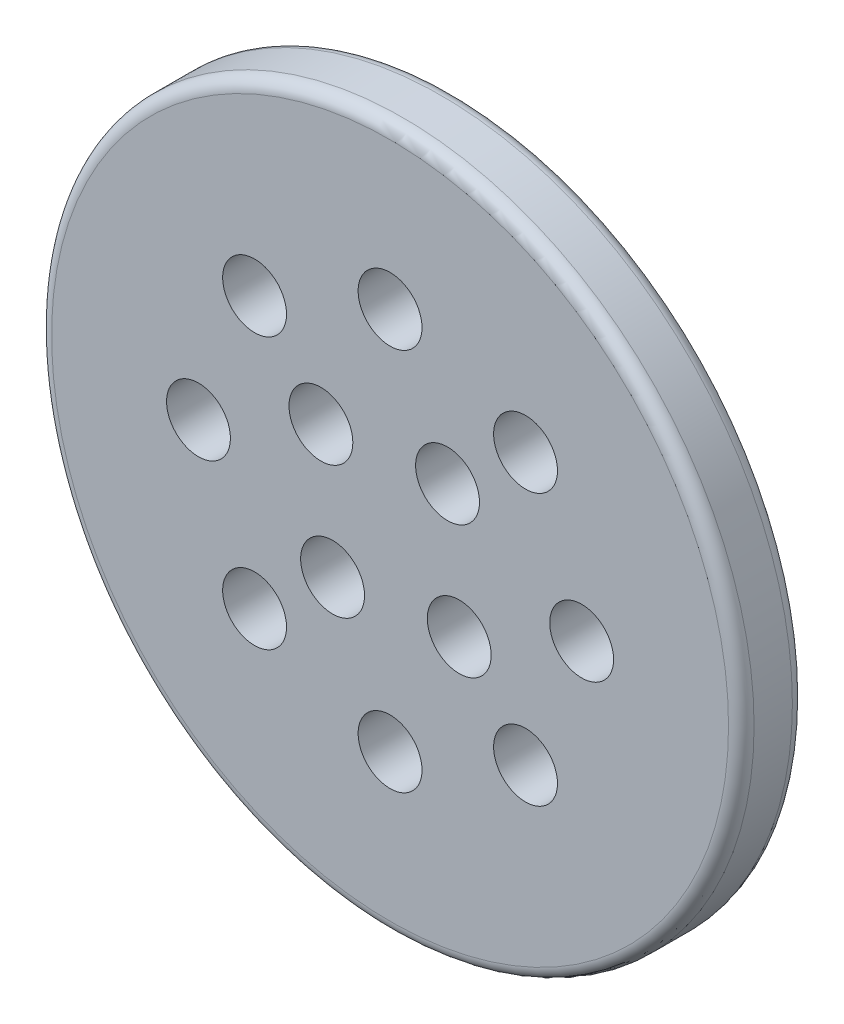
ISO-10303-21;
HEADER;
FILE_DESCRIPTION(('STEP AP214'),'2;1');
FILE_NAME('part.step','',(''),(''),'','','');
FILE_SCHEMA(('AUTOMOTIVE_DESIGN { 1 0 10303 214 1 1 1 1 }'));
ENDSEC;
DATA;
#1=APPLICATION_CONTEXT('core data for automotive mechanical design processes');
#2=APPLICATION_PROTOCOL_DEFINITION('international standard','automotive_design',2000,#1);
#3=PRODUCT_CONTEXT('',#1,'mechanical');
#4=PRODUCT('Part','Part','',(#3));
#5=PRODUCT_RELATED_PRODUCT_CATEGORY('part','',(#4));
#6=PRODUCT_DEFINITION_FORMATION('','',#4);
#7=PRODUCT_DEFINITION_CONTEXT('part definition',#1,'design');
#8=PRODUCT_DEFINITION('design','',#6,#7);
#9=PRODUCT_DEFINITION_SHAPE('','',#8);
#10=(LENGTH_UNIT() NAMED_UNIT(*) SI_UNIT(.MILLI.,.METRE.));
#11=(NAMED_UNIT(*) PLANE_ANGLE_UNIT() SI_UNIT($,.RADIAN.));
#12=(NAMED_UNIT(*) SI_UNIT($,.STERADIAN.) SOLID_ANGLE_UNIT());
#13=UNCERTAINTY_MEASURE_WITH_UNIT(LENGTH_MEASURE(1.E-05),#10,'distance_accuracy_value','');
#14=(GEOMETRIC_REPRESENTATION_CONTEXT(3) GLOBAL_UNCERTAINTY_ASSIGNED_CONTEXT((#13)) GLOBAL_UNIT_ASSIGNED_CONTEXT((#10,
#11,#12)) REPRESENTATION_CONTEXT('',''));
#15=CARTESIAN_POINT('',(0.,0.,0.));
#16=DIRECTION('',(0.,0.,1.));
#17=DIRECTION('',(1.,0.,0.));
#18=AXIS2_PLACEMENT_3D('',#15,#16,#17);
#19=CARTESIAN_POINT('',(0.,0.,10.));
#20=DIRECTION('',(0.,0.,1.));
#21=DIRECTION('',(1.,0.,0.));
#22=AXIS2_PLACEMENT_3D('',#19,#20,#21);
#23=TOROIDAL_SURFACE('',#22,265.,10.);
#24=CARTESIAN_POINT('',(0.,0.,0.));
#25=DIRECTION('',(0.,0.,1.));
#26=DIRECTION('',(1.,0.,0.));
#27=AXIS2_PLACEMENT_3D('',#24,#25,#26);
#28=CIRCLE('',#27,265.);
#29=CARTESIAN_POINT('',(265.,0.,0.));
#30=VERTEX_POINT('',#29);
#31=EDGE_CURVE('E37',#30,#30,#28,.F.);
#32=ORIENTED_EDGE('',*,*,#31,.F.);
#33=EDGE_LOOP('',(#32));
#34=FACE_BOUND('',#33,.T.);
#35=CARTESIAN_POINT('',(0.,0.,10.));
#36=DIRECTION('',(0.,0.,1.));
#37=DIRECTION('',(1.,0.,0.));
#38=AXIS2_PLACEMENT_3D('',#35,#36,#37);
#39=CIRCLE('',#38,275.);
#40=CARTESIAN_POINT('',(275.,0.,10.));
#41=VERTEX_POINT('',#40);
#42=EDGE_CURVE('E10',#41,#41,#39,.T.);
#43=ORIENTED_EDGE('',*,*,#42,.F.);
#44=EDGE_LOOP('',(#43));
#45=FACE_BOUND('',#44,.T.);
#46=ADVANCED_FACE('F31',(#34,#45),#23,.T.);
#47=CARTESIAN_POINT('',(0.,0.,40.));
#48=DIRECTION('',(0.,0.,1.));
#49=DIRECTION('',(1.,0.,0.));
#50=AXIS2_PLACEMENT_3D('',#47,#48,#49);
#51=TOROIDAL_SURFACE('',#50,265.,10.);
#52=CARTESIAN_POINT('',(0.,0.,40.));
#53=DIRECTION('',(0.,0.,1.));
#54=DIRECTION('',(1.,0.,0.));
#55=AXIS2_PLACEMENT_3D('',#52,#53,#54);
#56=CIRCLE('',#55,275.);
#57=CARTESIAN_POINT('',(275.,0.,40.));
#58=VERTEX_POINT('',#57);
#59=EDGE_CURVE('E45',#58,#58,#56,.F.);
#60=ORIENTED_EDGE('',*,*,#59,.F.);
#61=EDGE_LOOP('',(#60));
#62=FACE_BOUND('',#61,.T.);
#63=CARTESIAN_POINT('',(0.,0.,50.));
#64=DIRECTION('',(0.,0.,1.));
#65=DIRECTION('',(1.,0.,0.));
#66=AXIS2_PLACEMENT_3D('',#63,#64,#65);
#67=CIRCLE('',#66,265.);
#68=CARTESIAN_POINT('',(265.,0.,50.));
#69=VERTEX_POINT('',#68);
#70=EDGE_CURVE('E41',#69,#69,#67,.T.);
#71=ORIENTED_EDGE('',*,*,#70,.F.);
#72=EDGE_LOOP('',(#71));
#73=FACE_BOUND('',#72,.T.);
#74=ADVANCED_FACE('F129',(#62,#73),#51,.T.);
#75=CARTESIAN_POINT('',(0.,0.,50.));
#76=DIRECTION('',(0.,0.,1.));
#77=DIRECTION('',(1.,0.,0.));
#78=AXIS2_PLACEMENT_3D('',#75,#76,#77);
#79=PLANE('',#78);
#80=ORIENTED_EDGE('',*,*,#70,.T.);
#81=EDGE_LOOP('',(#80));
#82=FACE_BOUND('',#81,.T.);
#83=CARTESIAN_POINT('',(54.1510019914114,-45.0000000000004,50.));
#84=DIRECTION('',(0.,0.,1.));
#85=DIRECTION('',(1.,0.,0.));
#86=AXIS2_PLACEMENT_3D('',#83,#84,#85);
#87=CIRCLE('',#86,25.);
#88=CARTESIAN_POINT('',(79.1510019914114,-45.0000000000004,50.));
#89=VERTEX_POINT('',#88);
#90=EDGE_CURVE('E108',#89,#89,#87,.T.);
#91=ORIENTED_EDGE('',*,*,#90,.F.);
#92=EDGE_LOOP('',(#91));
#93=FACE_BOUND('',#92,.T.);
#94=CARTESIAN_POINT('',(-106.06601717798,106.066017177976,50.));
#95=DIRECTION('',(0.,0.,1.));
#96=DIRECTION('',(1.,0.,0.));
#97=AXIS2_PLACEMENT_3D('',#94,#95,#96);
#98=CIRCLE('',#97,25.0000000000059);
#99=CARTESIAN_POINT('',(-81.0660171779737,106.066017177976,50.));
#100=VERTEX_POINT('',#99);
#101=EDGE_CURVE('E96',#100,#100,#98,.T.);
#102=ORIENTED_EDGE('',*,*,#101,.F.);
#103=EDGE_LOOP('',(#102));
#104=FACE_BOUND('',#103,.T.);
#105=CARTESIAN_POINT('',(-106.066017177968,-106.066017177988,50.));
#106=DIRECTION('',(0.,0.,1.));
#107=DIRECTION('',(1.,0.,0.));
#108=AXIS2_PLACEMENT_3D('',#105,#106,#107);
#109=CIRCLE('',#108,25.0000000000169);
#110=CARTESIAN_POINT('',(-81.0660171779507,-106.066017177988,50.));
#111=VERTEX_POINT('',#110);
#112=EDGE_CURVE('E84',#111,#111,#109,.T.);
#113=ORIENTED_EDGE('',*,*,#112,.F.);
#114=EDGE_LOOP('',(#113));
#115=FACE_BOUND('',#114,.T.);
#116=CARTESIAN_POINT('',(106.066017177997,-106.066017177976,50.));
#117=DIRECTION('',(0.,0.,1.));
#118=DIRECTION('',(1.,0.,0.));
#119=AXIS2_PLACEMENT_3D('',#116,#117,#118);
#120=CIRCLE('',#119,25.0000000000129);
#121=CARTESIAN_POINT('',(131.06601717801,-106.066017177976,50.));
#122=VERTEX_POINT('',#121);
#123=EDGE_CURVE('E72',#122,#122,#120,.T.);
#124=ORIENTED_EDGE('',*,*,#123,.F.);
#125=EDGE_LOOP('',(#124));
#126=FACE_BOUND('',#125,.T.);
#127=CARTESIAN_POINT('',(106.066017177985,106.066017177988,50.));
#128=DIRECTION('',(0.,0.,1.));
#129=DIRECTION('',(1.,0.,0.));
#130=AXIS2_PLACEMENT_3D('',#127,#128,#129);
#131=CIRCLE('',#130,25.0000000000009);
#132=CARTESIAN_POINT('',(131.066017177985,106.066017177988,50.));
#133=VERTEX_POINT('',#132);
#134=EDGE_CURVE('E60',#133,#133,#131,.T.);
#135=ORIENTED_EDGE('',*,*,#134,.F.);
#136=EDGE_LOOP('',(#135));
#137=FACE_BOUND('',#136,.T.);
#138=CARTESIAN_POINT('',(0.,150.,50.));
#139=DIRECTION('',(0.,0.,1.));
#140=DIRECTION('',(1.,0.,0.));
#141=AXIS2_PLACEMENT_3D('',#138,#139,#140);
#142=CIRCLE('',#141,25.);
#143=CARTESIAN_POINT('',(25.,150.,50.));
#144=VERTEX_POINT('',#143);
#145=EDGE_CURVE('E50',#144,#144,#142,.T.);
#146=ORIENTED_EDGE('',*,*,#145,.F.);
#147=EDGE_LOOP('',(#146));
#148=FACE_BOUND('',#147,.T.);
#149=CARTESIAN_POINT('',(-54.1510019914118,45.,50.));
#150=DIRECTION('',(0.,0.,1.));
#151=DIRECTION('',(1.,0.,0.));
#152=AXIS2_PLACEMENT_3D('',#149,#150,#151);
#153=CIRCLE('',#152,25.);
#154=CARTESIAN_POINT('',(-29.1510019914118,45.,50.));
#155=VERTEX_POINT('',#154);
#156=EDGE_CURVE('E54',#155,#155,#153,.T.);
#157=ORIENTED_EDGE('',*,*,#156,.F.);
#158=EDGE_LOOP('',(#157));
#159=FACE_BOUND('',#158,.T.);
#160=CARTESIAN_POINT('',(150.000000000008,8.50814312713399E-12,50.));
#161=DIRECTION('',(0.,0.,1.));
#162=DIRECTION('',(1.,0.,0.));
#163=AXIS2_PLACEMENT_3D('',#160,#161,#162);
#164=CIRCLE('',#163,25.0000000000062);
#165=CARTESIAN_POINT('',(175.000000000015,8.50814312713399E-12,50.));
#166=VERTEX_POINT('',#165);
#167=EDGE_CURVE('E66',#166,#166,#164,.T.);
#168=ORIENTED_EDGE('',*,*,#167,.F.);
#169=EDGE_LOOP('',(#168));
#170=FACE_BOUND('',#169,.T.);
#171=CARTESIAN_POINT('',(1.7016286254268E-11,-150.,50.));
#172=DIRECTION('',(0.,0.,1.));
#173=DIRECTION('',(1.,0.,0.));
#174=AXIS2_PLACEMENT_3D('',#171,#172,#173);
#175=CIRCLE('',#174,25.0000000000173);
#176=CARTESIAN_POINT('',(25.0000000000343,-150.,50.));
#177=VERTEX_POINT('',#176);
#178=EDGE_CURVE('E78',#177,#177,#175,.T.);
#179=ORIENTED_EDGE('',*,*,#178,.F.);
#180=EDGE_LOOP('',(#179));
#181=FACE_BOUND('',#180,.T.);
#182=CARTESIAN_POINT('',(-149.999999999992,-8.52651282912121E-12,50.));
#183=DIRECTION('',(0.,0.,1.));
#184=DIRECTION('',(1.,0.,0.));
#185=AXIS2_PLACEMENT_3D('',#182,#183,#184);
#186=CIRCLE('',#185,25.0000000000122);
#187=CARTESIAN_POINT('',(-124.999999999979,-8.52651282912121E-12,50.));
#188=VERTEX_POINT('',#187);
#189=EDGE_CURVE('E90',#188,#188,#186,.T.);
#190=ORIENTED_EDGE('',*,*,#189,.F.);
#191=EDGE_LOOP('',(#190));
#192=FACE_BOUND('',#191,.T.);
#193=CARTESIAN_POINT('',(45.0000000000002,54.1510019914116,50.));
#194=DIRECTION('',(0.,0.,1.));
#195=DIRECTION('',(1.,0.,0.));
#196=AXIS2_PLACEMENT_3D('',#193,#194,#195);
#197=CIRCLE('',#196,25.);
#198=CARTESIAN_POINT('',(70.0000000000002,54.1510019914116,50.));
#199=VERTEX_POINT('',#198);
#200=EDGE_CURVE('E102',#199,#199,#197,.T.);
#201=ORIENTED_EDGE('',*,*,#200,.F.);
#202=EDGE_LOOP('',(#201));
#203=FACE_BOUND('',#202,.T.);
#204=CARTESIAN_POINT('',(-45.0000000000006,-54.1510019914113,50.));
#205=DIRECTION('',(0.,0.,1.));
#206=DIRECTION('',(1.,0.,0.));
#207=AXIS2_PLACEMENT_3D('',#204,#205,#206);
#208=CIRCLE('',#207,25.);
#209=CARTESIAN_POINT('',(-20.0000000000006,-54.1510019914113,50.));
#210=VERTEX_POINT('',#209);
#211=EDGE_CURVE('E114',#210,#210,#208,.T.);
#212=ORIENTED_EDGE('',*,*,#211,.F.);
#213=EDGE_LOOP('',(#212));
#214=FACE_BOUND('',#213,.T.);
#215=ADVANCED_FACE('F126',(#82,#93,#104,#115,#126,#137,#148,#159,#170,#181,#192,#203,#214),#79,.T.);
#216=CARTESIAN_POINT('',(0.,0.,0.));
#217=DIRECTION('',(0.,0.,1.));
#218=DIRECTION('',(1.,0.,0.));
#219=AXIS2_PLACEMENT_3D('',#216,#217,#218);
#220=PLANE('',#219);
#221=ORIENTED_EDGE('',*,*,#31,.T.);
#222=EDGE_LOOP('',(#221));
#223=FACE_BOUND('',#222,.T.);
#224=CARTESIAN_POINT('',(0.,150.,0.));
#225=DIRECTION('',(0.,0.,1.));
#226=DIRECTION('',(1.,0.,0.));
#227=AXIS2_PLACEMENT_3D('',#224,#225,#226);
#228=CIRCLE('',#227,25.);
#229=CARTESIAN_POINT('',(25.,150.,0.));
#230=VERTEX_POINT('',#229);
#231=EDGE_CURVE('E51',#230,#230,#228,.T.);
#232=ORIENTED_EDGE('',*,*,#231,.T.);
#233=EDGE_LOOP('',(#232));
#234=FACE_BOUND('',#233,.T.);
#235=CARTESIAN_POINT('',(-54.1510019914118,45.,0.));
#236=DIRECTION('',(0.,0.,1.));
#237=DIRECTION('',(1.,0.,0.));
#238=AXIS2_PLACEMENT_3D('',#235,#236,#237);
#239=CIRCLE('',#238,25.);
#240=CARTESIAN_POINT('',(-29.1510019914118,45.,0.));
#241=VERTEX_POINT('',#240);
#242=EDGE_CURVE('E57',#241,#241,#239,.T.);
#243=ORIENTED_EDGE('',*,*,#242,.T.);
#244=EDGE_LOOP('',(#243));
#245=FACE_BOUND('',#244,.T.);
#246=CARTESIAN_POINT('',(106.066017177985,106.066017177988,0.));
#247=DIRECTION('',(0.,0.,1.));
#248=DIRECTION('',(1.,0.,0.));
#249=AXIS2_PLACEMENT_3D('',#246,#247,#248);
#250=CIRCLE('',#249,25.0000000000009);
#251=CARTESIAN_POINT('',(131.066017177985,106.066017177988,0.));
#252=VERTEX_POINT('',#251);
#253=EDGE_CURVE('E63',#252,#252,#250,.T.);
#254=ORIENTED_EDGE('',*,*,#253,.T.);
#255=EDGE_LOOP('',(#254));
#256=FACE_BOUND('',#255,.T.);
#257=CARTESIAN_POINT('',(150.000000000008,8.50814312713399E-12,0.));
#258=DIRECTION('',(0.,0.,1.));
#259=DIRECTION('',(1.,0.,0.));
#260=AXIS2_PLACEMENT_3D('',#257,#258,#259);
#261=CIRCLE('',#260,25.0000000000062);
#262=CARTESIAN_POINT('',(175.000000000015,8.50814312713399E-12,0.));
#263=VERTEX_POINT('',#262);
#264=EDGE_CURVE('E69',#263,#263,#261,.T.);
#265=ORIENTED_EDGE('',*,*,#264,.T.);
#266=EDGE_LOOP('',(#265));
#267=FACE_BOUND('',#266,.T.);
#268=CARTESIAN_POINT('',(106.066017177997,-106.066017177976,0.));
#269=DIRECTION('',(0.,0.,1.));
#270=DIRECTION('',(1.,0.,0.));
#271=AXIS2_PLACEMENT_3D('',#268,#269,#270);
#272=CIRCLE('',#271,25.0000000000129);
#273=CARTESIAN_POINT('',(131.06601717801,-106.066017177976,0.));
#274=VERTEX_POINT('',#273);
#275=EDGE_CURVE('E75',#274,#274,#272,.T.);
#276=ORIENTED_EDGE('',*,*,#275,.T.);
#277=EDGE_LOOP('',(#276));
#278=FACE_BOUND('',#277,.T.);
#279=CARTESIAN_POINT('',(1.7016286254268E-11,-150.,0.));
#280=DIRECTION('',(0.,0.,1.));
#281=DIRECTION('',(1.,0.,0.));
#282=AXIS2_PLACEMENT_3D('',#279,#280,#281);
#283=CIRCLE('',#282,25.0000000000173);
#284=CARTESIAN_POINT('',(25.0000000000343,-150.,0.));
#285=VERTEX_POINT('',#284);
#286=EDGE_CURVE('E81',#285,#285,#283,.T.);
#287=ORIENTED_EDGE('',*,*,#286,.T.);
#288=EDGE_LOOP('',(#287));
#289=FACE_BOUND('',#288,.T.);
#290=CARTESIAN_POINT('',(-106.066017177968,-106.066017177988,0.));
#291=DIRECTION('',(0.,0.,1.));
#292=DIRECTION('',(1.,0.,0.));
#293=AXIS2_PLACEMENT_3D('',#290,#291,#292);
#294=CIRCLE('',#293,25.0000000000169);
#295=CARTESIAN_POINT('',(-81.0660171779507,-106.066017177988,0.));
#296=VERTEX_POINT('',#295);
#297=EDGE_CURVE('E87',#296,#296,#294,.T.);
#298=ORIENTED_EDGE('',*,*,#297,.T.);
#299=EDGE_LOOP('',(#298));
#300=FACE_BOUND('',#299,.T.);
#301=CARTESIAN_POINT('',(-149.999999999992,-8.52651282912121E-12,0.));
#302=DIRECTION('',(0.,0.,1.));
#303=DIRECTION('',(1.,0.,0.));
#304=AXIS2_PLACEMENT_3D('',#301,#302,#303);
#305=CIRCLE('',#304,25.0000000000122);
#306=CARTESIAN_POINT('',(-124.999999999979,-8.52651282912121E-12,0.));
#307=VERTEX_POINT('',#306);
#308=EDGE_CURVE('E93',#307,#307,#305,.T.);
#309=ORIENTED_EDGE('',*,*,#308,.T.);
#310=EDGE_LOOP('',(#309));
#311=FACE_BOUND('',#310,.T.);
#312=CARTESIAN_POINT('',(-106.06601717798,106.066017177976,0.));
#313=DIRECTION('',(0.,0.,1.));
#314=DIRECTION('',(1.,0.,0.));
#315=AXIS2_PLACEMENT_3D('',#312,#313,#314);
#316=CIRCLE('',#315,25.0000000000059);
#317=CARTESIAN_POINT('',(-81.0660171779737,106.066017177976,0.));
#318=VERTEX_POINT('',#317);
#319=EDGE_CURVE('E99',#318,#318,#316,.T.);
#320=ORIENTED_EDGE('',*,*,#319,.T.);
#321=EDGE_LOOP('',(#320));
#322=FACE_BOUND('',#321,.T.);
#323=CARTESIAN_POINT('',(45.0000000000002,54.1510019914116,0.));
#324=DIRECTION('',(0.,0.,1.));
#325=DIRECTION('',(1.,0.,0.));
#326=AXIS2_PLACEMENT_3D('',#323,#324,#325);
#327=CIRCLE('',#326,25.);
#328=CARTESIAN_POINT('',(70.0000000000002,54.1510019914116,0.));
#329=VERTEX_POINT('',#328);
#330=EDGE_CURVE('E105',#329,#329,#327,.T.);
#331=ORIENTED_EDGE('',*,*,#330,.T.);
#332=EDGE_LOOP('',(#331));
#333=FACE_BOUND('',#332,.T.);
#334=CARTESIAN_POINT('',(54.1510019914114,-45.0000000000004,0.));
#335=DIRECTION('',(0.,0.,1.));
#336=DIRECTION('',(1.,0.,0.));
#337=AXIS2_PLACEMENT_3D('',#334,#335,#336);
#338=CIRCLE('',#337,25.);
#339=CARTESIAN_POINT('',(79.1510019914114,-45.0000000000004,0.));
#340=VERTEX_POINT('',#339);
#341=EDGE_CURVE('E111',#340,#340,#338,.T.);
#342=ORIENTED_EDGE('',*,*,#341,.T.);
#343=EDGE_LOOP('',(#342));
#344=FACE_BOUND('',#343,.T.);
#345=CARTESIAN_POINT('',(-45.0000000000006,-54.1510019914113,0.));
#346=DIRECTION('',(0.,0.,1.));
#347=DIRECTION('',(1.,0.,0.));
#348=AXIS2_PLACEMENT_3D('',#345,#346,#347);
#349=CIRCLE('',#348,25.);
#350=CARTESIAN_POINT('',(-20.0000000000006,-54.1510019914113,0.));
#351=VERTEX_POINT('',#350);
#352=EDGE_CURVE('E117',#351,#351,#349,.T.);
#353=ORIENTED_EDGE('',*,*,#352,.T.);
#354=EDGE_LOOP('',(#353));
#355=FACE_BOUND('',#354,.T.);
#356=ADVANCED_FACE('F128',(#223,#234,#245,#256,#267,#278,#289,#300,#311,#322,#333,#344,#355),
#220,.F.);
#357=CARTESIAN_POINT('',(0.,0.,50.));
#358=DIRECTION('',(0.,0.,-1.));
#359=DIRECTION('',(-1.,0.,0.));
#360=AXIS2_PLACEMENT_3D('',#357,#358,#359);
#361=CYLINDRICAL_SURFACE('',#360,275.);
#362=ORIENTED_EDGE('',*,*,#42,.T.);
#363=EDGE_LOOP('',(#362));
#364=FACE_BOUND('',#363,.T.);
#365=ORIENTED_EDGE('',*,*,#59,.T.);
#366=EDGE_LOOP('',(#365));
#367=FACE_BOUND('',#366,.T.);
#368=ADVANCED_FACE('F136',(#364,#367),#361,.T.);
#369=CARTESIAN_POINT('',(0.,150.,50.));
#370=DIRECTION('',(0.,0.,-1.));
#371=DIRECTION('',(-1.,0.,0.));
#372=AXIS2_PLACEMENT_3D('',#369,#370,#371);
#373=CYLINDRICAL_SURFACE('',#372,25.);
#374=ORIENTED_EDGE('',*,*,#145,.T.);
#375=EDGE_LOOP('',(#374));
#376=FACE_BOUND('',#375,.T.);
#377=ORIENTED_EDGE('',*,*,#231,.F.);
#378=EDGE_LOOP('',(#377));
#379=FACE_BOUND('',#378,.T.);
#380=ADVANCED_FACE('F174',(#376,#379),#373,.F.);
#381=CARTESIAN_POINT('',(-54.1510019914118,45.,50.));
#382=DIRECTION('',(0.,0.,-1.));
#383=DIRECTION('',(-1.,0.,0.));
#384=AXIS2_PLACEMENT_3D('',#381,#382,#383);
#385=CYLINDRICAL_SURFACE('',#384,25.);
#386=ORIENTED_EDGE('',*,*,#156,.T.);
#387=EDGE_LOOP('',(#386));
#388=FACE_BOUND('',#387,.T.);
#389=ORIENTED_EDGE('',*,*,#242,.F.);
#390=EDGE_LOOP('',(#389));
#391=FACE_BOUND('',#390,.T.);
#392=ADVANCED_FACE('F182',(#388,#391),#385,.F.);
#393=CARTESIAN_POINT('',(106.066017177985,106.066017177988,50.));
#394=DIRECTION('',(0.,0.,-1.));
#395=DIRECTION('',(-1.,0.,0.));
#396=AXIS2_PLACEMENT_3D('',#393,#394,#395);
#397=CYLINDRICAL_SURFACE('',#396,25.0000000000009);
#398=ORIENTED_EDGE('',*,*,#134,.T.);
#399=EDGE_LOOP('',(#398));
#400=FACE_BOUND('',#399,.T.);
#401=ORIENTED_EDGE('',*,*,#253,.F.);
#402=EDGE_LOOP('',(#401));
#403=FACE_BOUND('',#402,.T.);
#404=ADVANCED_FACE('F190',(#400,#403),#397,.F.);
#405=CARTESIAN_POINT('',(150.000000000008,8.50814312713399E-12,50.));
#406=DIRECTION('',(0.,0.,-1.));
#407=DIRECTION('',(-1.,0.,0.));
#408=AXIS2_PLACEMENT_3D('',#405,#406,#407);
#409=CYLINDRICAL_SURFACE('',#408,25.0000000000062);
#410=ORIENTED_EDGE('',*,*,#167,.T.);
#411=EDGE_LOOP('',(#410));
#412=FACE_BOUND('',#411,.T.);
#413=ORIENTED_EDGE('',*,*,#264,.F.);
#414=EDGE_LOOP('',(#413));
#415=FACE_BOUND('',#414,.T.);
#416=ADVANCED_FACE('F199',(#412,#415),#409,.F.);
#417=CARTESIAN_POINT('',(106.066017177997,-106.066017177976,50.));
#418=DIRECTION('',(0.,0.,-1.));
#419=DIRECTION('',(-1.,0.,0.));
#420=AXIS2_PLACEMENT_3D('',#417,#418,#419);
#421=CYLINDRICAL_SURFACE('',#420,25.0000000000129);
#422=ORIENTED_EDGE('',*,*,#123,.T.);
#423=EDGE_LOOP('',(#422));
#424=FACE_BOUND('',#423,.T.);
#425=ORIENTED_EDGE('',*,*,#275,.F.);
#426=EDGE_LOOP('',(#425));
#427=FACE_BOUND('',#426,.T.);
#428=ADVANCED_FACE('F208',(#424,#427),#421,.F.);
#429=CARTESIAN_POINT('',(1.7016286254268E-11,-150.,50.));
#430=DIRECTION('',(0.,0.,-1.));
#431=DIRECTION('',(-1.,0.,0.));
#432=AXIS2_PLACEMENT_3D('',#429,#430,#431);
#433=CYLINDRICAL_SURFACE('',#432,25.0000000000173);
#434=ORIENTED_EDGE('',*,*,#178,.T.);
#435=EDGE_LOOP('',(#434));
#436=FACE_BOUND('',#435,.T.);
#437=ORIENTED_EDGE('',*,*,#286,.F.);
#438=EDGE_LOOP('',(#437));
#439=FACE_BOUND('',#438,.T.);
#440=ADVANCED_FACE('F217',(#436,#439),#433,.F.);
#441=CARTESIAN_POINT('',(-106.066017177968,-106.066017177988,50.));
#442=DIRECTION('',(0.,0.,-1.));
#443=DIRECTION('',(-1.,0.,0.));
#444=AXIS2_PLACEMENT_3D('',#441,#442,#443);
#445=CYLINDRICAL_SURFACE('',#444,25.0000000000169);
#446=ORIENTED_EDGE('',*,*,#112,.T.);
#447=EDGE_LOOP('',(#446));
#448=FACE_BOUND('',#447,.T.);
#449=ORIENTED_EDGE('',*,*,#297,.F.);
#450=EDGE_LOOP('',(#449));
#451=FACE_BOUND('',#450,.T.);
#452=ADVANCED_FACE('F226',(#448,#451),#445,.F.);
#453=CARTESIAN_POINT('',(-149.999999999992,-8.52651282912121E-12,50.));
#454=DIRECTION('',(0.,0.,-1.));
#455=DIRECTION('',(-1.,0.,0.));
#456=AXIS2_PLACEMENT_3D('',#453,#454,#455);
#457=CYLINDRICAL_SURFACE('',#456,25.0000000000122);
#458=ORIENTED_EDGE('',*,*,#189,.T.);
#459=EDGE_LOOP('',(#458));
#460=FACE_BOUND('',#459,.T.);
#461=ORIENTED_EDGE('',*,*,#308,.F.);
#462=EDGE_LOOP('',(#461));
#463=FACE_BOUND('',#462,.T.);
#464=ADVANCED_FACE('F235',(#460,#463),#457,.F.);
#465=CARTESIAN_POINT('',(-106.06601717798,106.066017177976,50.));
#466=DIRECTION('',(0.,0.,-1.));
#467=DIRECTION('',(-1.,0.,0.));
#468=AXIS2_PLACEMENT_3D('',#465,#466,#467);
#469=CYLINDRICAL_SURFACE('',#468,25.0000000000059);
#470=ORIENTED_EDGE('',*,*,#101,.T.);
#471=EDGE_LOOP('',(#470));
#472=FACE_BOUND('',#471,.T.);
#473=ORIENTED_EDGE('',*,*,#319,.F.);
#474=EDGE_LOOP('',(#473));
#475=FACE_BOUND('',#474,.T.);
#476=ADVANCED_FACE('F244',(#472,#475),#469,.F.);
#477=CARTESIAN_POINT('',(45.0000000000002,54.1510019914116,50.));
#478=DIRECTION('',(0.,0.,-1.));
#479=DIRECTION('',(-1.,0.,0.));
#480=AXIS2_PLACEMENT_3D('',#477,#478,#479);
#481=CYLINDRICAL_SURFACE('',#480,25.);
#482=ORIENTED_EDGE('',*,*,#200,.T.);
#483=EDGE_LOOP('',(#482));
#484=FACE_BOUND('',#483,.T.);
#485=ORIENTED_EDGE('',*,*,#330,.F.);
#486=EDGE_LOOP('',(#485));
#487=FACE_BOUND('',#486,.T.);
#488=ADVANCED_FACE('F253',(#484,#487),#481,.F.);
#489=CARTESIAN_POINT('',(54.1510019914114,-45.0000000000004,50.));
#490=DIRECTION('',(0.,0.,-1.));
#491=DIRECTION('',(-1.,0.,0.));
#492=AXIS2_PLACEMENT_3D('',#489,#490,#491);
#493=CYLINDRICAL_SURFACE('',#492,25.);
#494=ORIENTED_EDGE('',*,*,#90,.T.);
#495=EDGE_LOOP('',(#494));
#496=FACE_BOUND('',#495,.T.);
#497=ORIENTED_EDGE('',*,*,#341,.F.);
#498=EDGE_LOOP('',(#497));
#499=FACE_BOUND('',#498,.T.);
#500=ADVANCED_FACE('F262',(#496,#499),#493,.F.);
#501=CARTESIAN_POINT('',(-45.0000000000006,-54.1510019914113,50.));
#502=DIRECTION('',(0.,0.,-1.));
#503=DIRECTION('',(-1.,0.,0.));
#504=AXIS2_PLACEMENT_3D('',#501,#502,#503);
#505=CYLINDRICAL_SURFACE('',#504,25.);
#506=ORIENTED_EDGE('',*,*,#211,.T.);
#507=EDGE_LOOP('',(#506));
#508=FACE_BOUND('',#507,.T.);
#509=ORIENTED_EDGE('',*,*,#352,.F.);
#510=EDGE_LOOP('',(#509));
#511=FACE_BOUND('',#510,.T.);
#512=ADVANCED_FACE('F123',(#508,#511),#505,.F.);
#513=CLOSED_SHELL('',(#46,#74,#215,#356,#368,#380,#392,#404,#416,#428,#440,#452,#464,#476,#488,
#500,#512));
#514=MANIFOLD_SOLID_BREP('B2',#513);
#515=ADVANCED_BREP_SHAPE_REPRESENTATION('',(#18,#514),#14);
#516=SHAPE_DEFINITION_REPRESENTATION(#9,#515);
ENDSEC;
END-ISO-10303-21;
